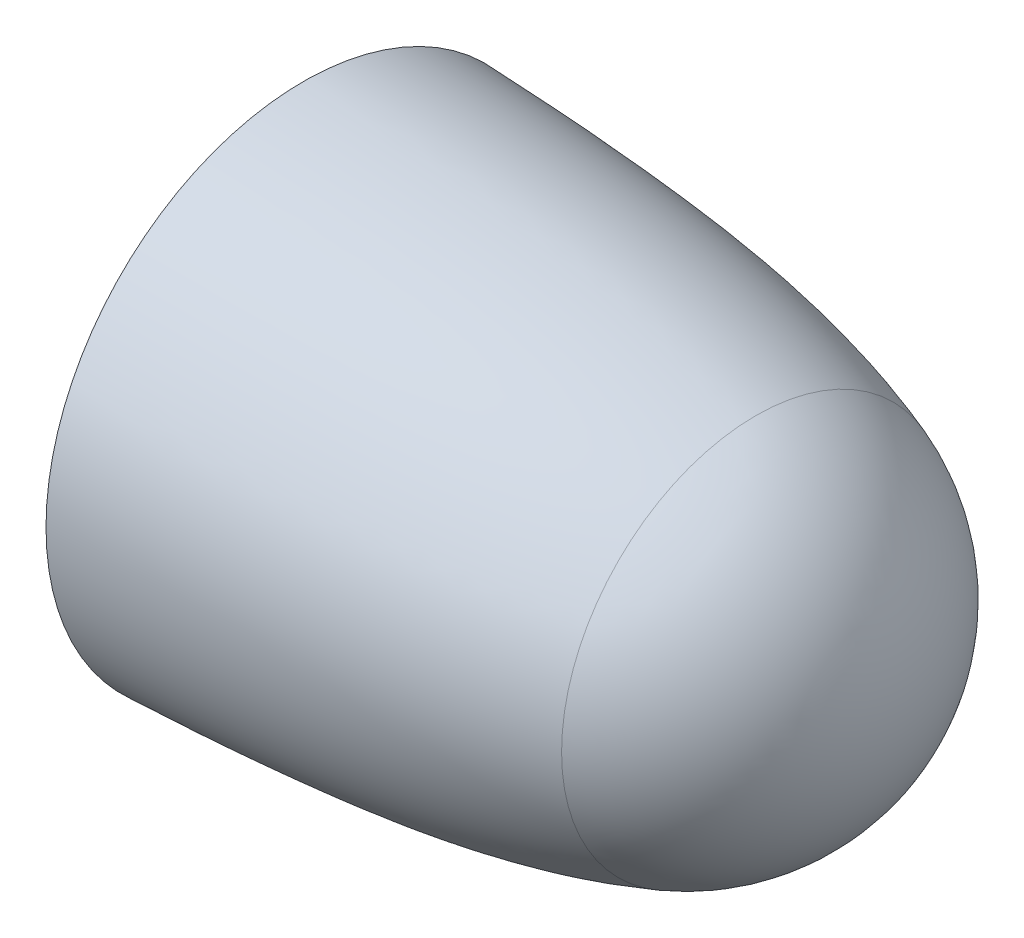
from build123d import *


with BuildPart() as part:
    # Sketch1 → Revolve6 (revolve)
    with BuildSketch(Plane.XY):
        with BuildLine():
            Line((4343.4, 399.270494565), (4343.4, 392.916330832))
            add(Edge.make_bspline(
                [(5043.243270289, 295.399458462), (5036.275215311, 297.886874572), (5022.275998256, 302.723981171), (4994.189494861, 311.812219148), (4958.850431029, 322.141552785), (4916.122949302, 333.011264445), (4858.75230778, 345.649722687), (4786.357516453, 358.298549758), (4698.610212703, 369.504641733), (4610.203419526, 377.776971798), (4521.379864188, 384.265131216), (4432.416672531, 389.326768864), (4373.047161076, 391.842062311), (4343.4, 392.916330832)],
                knots=[0, 0, 0, 0, 0.016190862, 0.032381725, 0.06476345, 0.097145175, 0.129526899, 0.194290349, 0.259053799, 0.323817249, 0.388580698, 0.453344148, 0.517940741, 0.517940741, 0.517940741, 0.517940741], degree=3))
            ThreePointArc((5043.243270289, 295.399458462), (5194.167650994, 180.700638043), (5251.45, 0))
            Line((5251.45, 0), (5257.8, 0))
            ThreePointArc((5257.8, 0), (5199.357966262, 184.358933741), (5045.378112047, 301.37983894))
            add(Edge.make_bspline(
                [(5045.378112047, 301.37983894), (4898.105789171, 353.952264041), (4663.325450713, 383.641905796), (4425.322698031, 396.304609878), (4343.4, 399.270494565)],
                knots=[0, 0, 0, 0, 0.339771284, 0.518107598, 0.518107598, 0.518107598, 0.518107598], degree=3))
        make_face()
    revolve(axis=Axis((4343.378585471, 0, 0), (1, 0, 0)))


solid = part.part
